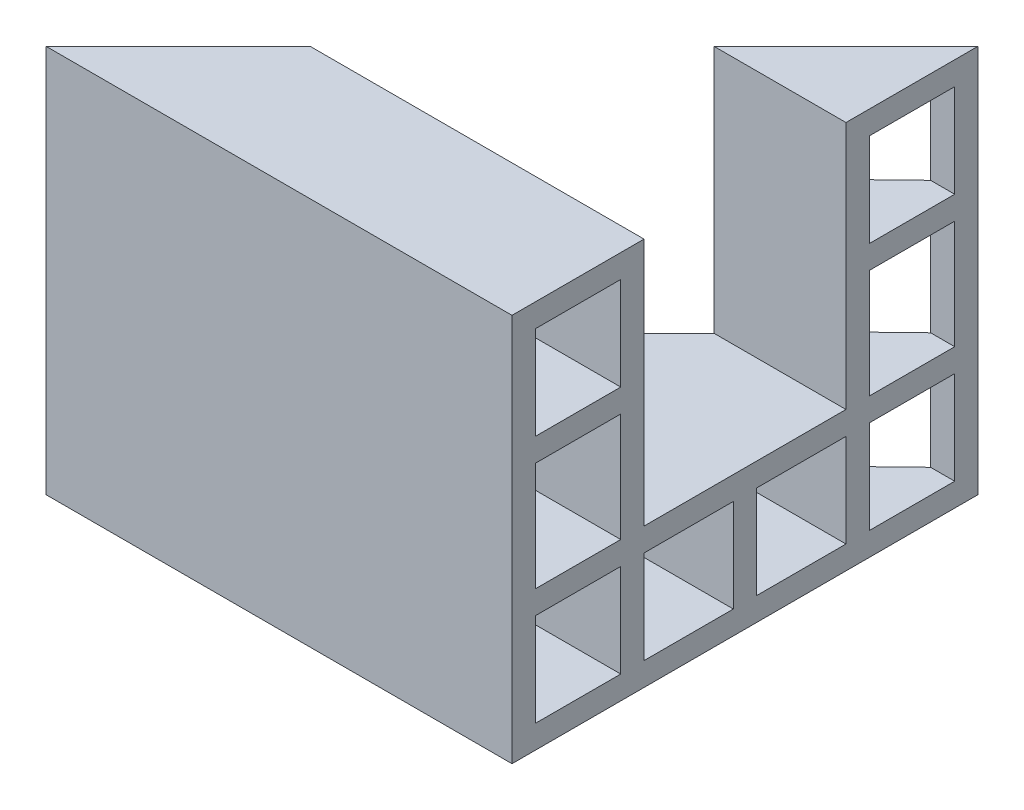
ISO-10303-21;
HEADER;
FILE_DESCRIPTION(('STEP AP214'),'2;1');
FILE_NAME('part.step','',(''),(''),'','','');
FILE_SCHEMA(('AUTOMOTIVE_DESIGN { 1 0 10303 214 1 1 1 1 }'));
ENDSEC;
DATA;
#1=APPLICATION_CONTEXT('core data for automotive mechanical design processes');
#2=APPLICATION_PROTOCOL_DEFINITION('international standard','automotive_design',2000,#1);
#3=PRODUCT_CONTEXT('',#1,'mechanical');
#4=PRODUCT('Part','Part','',(#3));
#5=PRODUCT_RELATED_PRODUCT_CATEGORY('part','',(#4));
#6=PRODUCT_DEFINITION_FORMATION('','',#4);
#7=PRODUCT_DEFINITION_CONTEXT('part definition',#1,'design');
#8=PRODUCT_DEFINITION('design','',#6,#7);
#9=PRODUCT_DEFINITION_SHAPE('','',#8);
#10=(LENGTH_UNIT() NAMED_UNIT(*) SI_UNIT(.MILLI.,.METRE.));
#11=(NAMED_UNIT(*) PLANE_ANGLE_UNIT() SI_UNIT($,.RADIAN.));
#12=(NAMED_UNIT(*) SI_UNIT($,.STERADIAN.) SOLID_ANGLE_UNIT());
#13=UNCERTAINTY_MEASURE_WITH_UNIT(LENGTH_MEASURE(1.E-05),#10,'distance_accuracy_value','');
#14=(GEOMETRIC_REPRESENTATION_CONTEXT(3) GLOBAL_UNCERTAINTY_ASSIGNED_CONTEXT((#13)) GLOBAL_UNIT_ASSIGNED_CONTEXT((#10,
#11,#12)) REPRESENTATION_CONTEXT('',''));
#15=CARTESIAN_POINT('',(0.,0.,0.));
#16=DIRECTION('',(0.,0.,1.));
#17=DIRECTION('',(1.,0.,0.));
#18=AXIS2_PLACEMENT_3D('',#15,#16,#17);
#19=CARTESIAN_POINT('',(30.,9.,-21.5));
#20=DIRECTION('',(-1.,0.,0.));
#21=DIRECTION('',(0.,0.,1.));
#22=AXIS2_PLACEMENT_3D('',#19,#20,#21);
#23=PLANE('',#22);
#24=DIRECTION('',(0.,0.,1.));
#25=VECTOR('',#24,1.);
#26=CARTESIAN_POINT('',(30.,16.,-28.5));
#27=LINE('',#26,#25);
#28=CARTESIAN_POINT('',(30.,16.,-28.5));
#29=VERTEX_POINT('',#28);
#30=CARTESIAN_POINT('',(30.,16.,-23.));
#31=VERTEX_POINT('',#30);
#32=EDGE_CURVE('E403',#29,#31,#27,.T.);
#33=ORIENTED_EDGE('',*,*,#32,.F.);
#34=DIRECTION('',(0.,1.,0.));
#35=VECTOR('',#34,1.);
#36=CARTESIAN_POINT('',(30.,16.,-28.5));
#37=LINE('',#36,#35);
#38=CARTESIAN_POINT('',(30.,9.,-28.5));
#39=VERTEX_POINT('',#38);
#40=EDGE_CURVE('E413',#39,#29,#37,.T.);
#41=ORIENTED_EDGE('',*,*,#40,.F.);
#42=DIRECTION('',(0.,0.,-1.));
#43=VECTOR('',#42,1.);
#44=CARTESIAN_POINT('',(30.,9.,-28.5));
#45=LINE('',#44,#43);
#46=CARTESIAN_POINT('',(30.,9.,-23.));
#47=VERTEX_POINT('',#46);
#48=EDGE_CURVE('E428',#47,#39,#45,.T.);
#49=ORIENTED_EDGE('',*,*,#48,.F.);
#50=DIRECTION('',(0.,-1.,0.));
#51=VECTOR('',#50,1.);
#52=CARTESIAN_POINT('',(30.,16.,-23.));
#53=LINE('',#52,#51);
#54=EDGE_CURVE('E510',#31,#47,#53,.T.);
#55=ORIENTED_EDGE('',*,*,#54,.F.);
#56=EDGE_LOOP('',(#33,#41,#49,#55));
#57=FACE_BOUND('',#56,.T.);
#58=DIRECTION('',(0.,0.,1.));
#59=VECTOR('',#58,1.);
#60=CARTESIAN_POINT('',(30.,7.5,-21.5));
#61=LINE('',#60,#59);
#62=CARTESIAN_POINT('',(30.,7.5,-21.5));
#63=VERTEX_POINT('',#62);
#64=CARTESIAN_POINT('',(30.,7.5,-15.75));
#65=VERTEX_POINT('',#64);
#66=EDGE_CURVE('E316',#63,#65,#61,.T.);
#67=ORIENTED_EDGE('',*,*,#66,.F.);
#68=DIRECTION('',(0.,1.,0.));
#69=VECTOR('',#68,1.);
#70=CARTESIAN_POINT('',(30.,7.5,-21.5));
#71=LINE('',#70,#69);
#72=CARTESIAN_POINT('',(30.,1.5,-21.5));
#73=VERTEX_POINT('',#72);
#74=EDGE_CURVE('E385',#73,#63,#71,.T.);
#75=ORIENTED_EDGE('',*,*,#74,.F.);
#76=DIRECTION('',(0.,0.,-1.));
#77=VECTOR('',#76,1.);
#78=CARTESIAN_POINT('',(30.,1.5,-21.5));
#79=LINE('',#78,#77);
#80=CARTESIAN_POINT('',(30.,1.5,-15.75));
#81=VERTEX_POINT('',#80);
#82=EDGE_CURVE('E524',#81,#73,#79,.T.);
#83=ORIENTED_EDGE('',*,*,#82,.F.);
#84=DIRECTION('',(0.,-1.,0.));
#85=VECTOR('',#84,1.);
#86=CARTESIAN_POINT('',(30.,7.5,-15.75));
#87=LINE('',#86,#85);
#88=EDGE_CURVE('E522',#65,#81,#87,.T.);
#89=ORIENTED_EDGE('',*,*,#88,.F.);
#90=EDGE_LOOP('',(#67,#75,#83,#89));
#91=FACE_BOUND('',#90,.T.);
#92=DIRECTION('',(0.,0.,-1.));
#93=VECTOR('',#92,1.);
#94=CARTESIAN_POINT('',(30.,17.5,-1.5));
#95=LINE('',#94,#93);
#96=CARTESIAN_POINT('',(30.,17.5,-1.5));
#97=VERTEX_POINT('',#96);
#98=CARTESIAN_POINT('',(30.,17.5,-7.));
#99=VERTEX_POINT('',#98);
#100=EDGE_CURVE('E344',#97,#99,#95,.T.);
#101=ORIENTED_EDGE('',*,*,#100,.F.);
#102=DIRECTION('',(0.,-1.,0.));
#103=VECTOR('',#102,1.);
#104=CARTESIAN_POINT('',(30.,17.5,-1.5));
#105=LINE('',#104,#103);
#106=CARTESIAN_POINT('',(30.,23.5,-1.5));
#107=VERTEX_POINT('',#106);
#108=EDGE_CURVE('E365',#107,#97,#105,.T.);
#109=ORIENTED_EDGE('',*,*,#108,.F.);
#110=DIRECTION('',(0.,0.,1.));
#111=VECTOR('',#110,1.);
#112=CARTESIAN_POINT('',(30.,23.5,-1.5));
#113=LINE('',#112,#111);
#114=CARTESIAN_POINT('',(30.,23.5,-7.));
#115=VERTEX_POINT('',#114);
#116=EDGE_CURVE('E538',#115,#107,#113,.T.);
#117=ORIENTED_EDGE('',*,*,#116,.F.);
#118=DIRECTION('',(0.,1.,0.));
#119=VECTOR('',#118,1.);
#120=CARTESIAN_POINT('',(30.,17.5,-7.));
#121=LINE('',#120,#119);
#122=EDGE_CURVE('E536',#99,#115,#121,.T.);
#123=ORIENTED_EDGE('',*,*,#122,.F.);
#124=EDGE_LOOP('',(#101,#109,#117,#123));
#125=FACE_BOUND('',#124,.T.);
#126=DIRECTION('',(0.,-1.,0.));
#127=VECTOR('',#126,1.);
#128=CARTESIAN_POINT('',(30.,7.5,-8.5));
#129=LINE('',#128,#127);
#130=CARTESIAN_POINT('',(30.,7.5,-8.5));
#131=VERTEX_POINT('',#130);
#132=CARTESIAN_POINT('',(30.,1.5,-8.5));
#133=VERTEX_POINT('',#132);
#134=EDGE_CURVE('E338',#131,#133,#129,.T.);
#135=ORIENTED_EDGE('',*,*,#134,.F.);
#136=DIRECTION('',(0.,0.,1.));
#137=VECTOR('',#136,1.);
#138=CARTESIAN_POINT('',(30.,7.5,-8.5));
#139=LINE('',#138,#137);
#140=CARTESIAN_POINT('',(30.,7.5,-14.25));
#141=VERTEX_POINT('',#140);
#142=EDGE_CURVE('E376',#141,#131,#139,.T.);
#143=ORIENTED_EDGE('',*,*,#142,.F.);
#144=DIRECTION('',(0.,1.,0.));
#145=VECTOR('',#144,1.);
#146=CARTESIAN_POINT('',(30.,7.5,-14.25));
#147=LINE('',#146,#145);
#148=CARTESIAN_POINT('',(30.,1.5,-14.25));
#149=VERTEX_POINT('',#148);
#150=EDGE_CURVE('E552',#149,#141,#147,.T.);
#151=ORIENTED_EDGE('',*,*,#150,.F.);
#152=DIRECTION('',(0.,0.,-1.));
#153=VECTOR('',#152,1.);
#154=CARTESIAN_POINT('',(30.,1.5,-8.5));
#155=LINE('',#154,#153);
#156=EDGE_CURVE('E550',#133,#149,#155,.T.);
#157=ORIENTED_EDGE('',*,*,#156,.F.);
#158=EDGE_LOOP('',(#135,#143,#151,#157));
#159=FACE_BOUND('',#158,.T.);
#160=DIRECTION('',(0.,-1.,0.));
#161=VECTOR('',#160,1.);
#162=CARTESIAN_POINT('',(30.,9.,-21.5));
#163=LINE('',#162,#161);
#164=CARTESIAN_POINT('',(30.,25.,-21.5));
#165=VERTEX_POINT('',#164);
#166=CARTESIAN_POINT('',(30.,9.,-21.5));
#167=VERTEX_POINT('',#166);
#168=EDGE_CURVE('E285',#165,#167,#163,.T.);
#169=ORIENTED_EDGE('',*,*,#168,.T.);
#170=DIRECTION('',(0.,0.,1.));
#171=VECTOR('',#170,1.);
#172=CARTESIAN_POINT('',(30.,9.,-8.5));
#173=LINE('',#172,#171);
#174=CARTESIAN_POINT('',(30.,9.,-8.5));
#175=VERTEX_POINT('',#174);
#176=EDGE_CURVE('E558',#167,#175,#173,.T.);
#177=ORIENTED_EDGE('',*,*,#176,.T.);
#178=DIRECTION('',(0.,1.,0.));
#179=VECTOR('',#178,1.);
#180=CARTESIAN_POINT('',(30.,9.,-8.5));
#181=LINE('',#180,#179);
#182=CARTESIAN_POINT('',(30.,25.,-8.5));
#183=VERTEX_POINT('',#182);
#184=EDGE_CURVE('E560',#175,#183,#181,.T.);
#185=ORIENTED_EDGE('',*,*,#184,.T.);
#186=DIRECTION('',(0.,0.,1.));
#187=VECTOR('',#186,1.);
#188=CARTESIAN_POINT('',(30.,25.,-8.5));
#189=LINE('',#188,#187);
#190=CARTESIAN_POINT('',(30.,25.,0.));
#191=VERTEX_POINT('',#190);
#192=EDGE_CURVE('E562',#183,#191,#189,.T.);
#193=ORIENTED_EDGE('',*,*,#192,.T.);
#194=DIRECTION('',(0.,-1.,0.));
#195=VECTOR('',#194,1.);
#196=CARTESIAN_POINT('',(30.,25.,0.));
#197=LINE('',#196,#195);
#198=CARTESIAN_POINT('',(30.,0.,0.));
#199=VERTEX_POINT('',#198);
#200=EDGE_CURVE('E300',#191,#199,#197,.T.);
#201=ORIENTED_EDGE('',*,*,#200,.T.);
#202=DIRECTION('',(0.,0.,-1.));
#203=VECTOR('',#202,1.);
#204=CARTESIAN_POINT('',(30.,0.,0.));
#205=LINE('',#204,#203);
#206=CARTESIAN_POINT('',(30.,0.,-30.));
#207=VERTEX_POINT('',#206);
#208=EDGE_CURVE('E565',#199,#207,#205,.T.);
#209=ORIENTED_EDGE('',*,*,#208,.T.);
#210=DIRECTION('',(0.,1.,0.));
#211=VECTOR('',#210,1.);
#212=CARTESIAN_POINT('',(30.,25.,-30.));
#213=LINE('',#212,#211);
#214=CARTESIAN_POINT('',(30.,25.,-30.));
#215=VERTEX_POINT('',#214);
#216=EDGE_CURVE('E568',#207,#215,#213,.T.);
#217=ORIENTED_EDGE('',*,*,#216,.T.);
#218=DIRECTION('',(0.,0.,1.));
#219=VECTOR('',#218,1.);
#220=CARTESIAN_POINT('',(30.,25.,-21.5));
#221=LINE('',#220,#219);
#222=EDGE_CURVE('E571',#215,#165,#221,.T.);
#223=ORIENTED_EDGE('',*,*,#222,.T.);
#224=EDGE_LOOP('',(#169,#177,#185,#193,#201,#209,#217,#223));
#225=FACE_BOUND('',#224,.T.);
#226=DIRECTION('',(0.,-1.,0.));
#227=VECTOR('',#226,1.);
#228=CARTESIAN_POINT('',(30.,7.5,-1.5));
#229=LINE('',#228,#227);
#230=CARTESIAN_POINT('',(30.,7.5,-1.5));
#231=VERTEX_POINT('',#230);
#232=CARTESIAN_POINT('',(30.,1.5,-1.5));
#233=VERTEX_POINT('',#232);
#234=EDGE_CURVE('E368',#231,#233,#229,.T.);
#235=ORIENTED_EDGE('',*,*,#234,.F.);
#236=DIRECTION('',(0.,0.,1.));
#237=VECTOR('',#236,1.);
#238=CARTESIAN_POINT('',(30.,7.5,-1.5));
#239=LINE('',#238,#237);
#240=CARTESIAN_POINT('',(30.,7.5,-7.));
#241=VERTEX_POINT('',#240);
#242=EDGE_CURVE('E334',#241,#231,#239,.T.);
#243=ORIENTED_EDGE('',*,*,#242,.F.);
#244=DIRECTION('',(0.,1.,0.));
#245=VECTOR('',#244,1.);
#246=CARTESIAN_POINT('',(30.,7.5,-7.));
#247=LINE('',#246,#245);
#248=CARTESIAN_POINT('',(30.,1.5,-7.));
#249=VERTEX_POINT('',#248);
#250=EDGE_CURVE('E545',#249,#241,#247,.T.);
#251=ORIENTED_EDGE('',*,*,#250,.F.);
#252=DIRECTION('',(0.,0.,-1.));
#253=VECTOR('',#252,1.);
#254=CARTESIAN_POINT('',(30.,1.5,-1.5));
#255=LINE('',#254,#253);
#256=EDGE_CURVE('E543',#233,#249,#255,.T.);
#257=ORIENTED_EDGE('',*,*,#256,.F.);
#258=EDGE_LOOP('',(#235,#243,#251,#257));
#259=FACE_BOUND('',#258,.T.);
#260=DIRECTION('',(0.,1.,0.));
#261=VECTOR('',#260,1.);
#262=CARTESIAN_POINT('',(30.,16.,-7.));
#263=LINE('',#262,#261);
#264=CARTESIAN_POINT('',(30.,9.,-7.));
#265=VERTEX_POINT('',#264);
#266=CARTESIAN_POINT('',(30.,16.,-7.));
#267=VERTEX_POINT('',#266);
#268=EDGE_CURVE('E389',#265,#267,#263,.T.);
#269=ORIENTED_EDGE('',*,*,#268,.F.);
#270=DIRECTION('',(0.,0.,-1.));
#271=VECTOR('',#270,1.);
#272=CARTESIAN_POINT('',(30.,9.,-1.5));
#273=LINE('',#272,#271);
#274=CARTESIAN_POINT('',(30.,9.,-1.5));
#275=VERTEX_POINT('',#274);
#276=EDGE_CURVE('E354',#275,#265,#273,.T.);
#277=ORIENTED_EDGE('',*,*,#276,.F.);
#278=DIRECTION('',(0.,-1.,0.));
#279=VECTOR('',#278,1.);
#280=CARTESIAN_POINT('',(30.,16.,-1.5));
#281=LINE('',#280,#279);
#282=CARTESIAN_POINT('',(30.,16.,-1.5));
#283=VERTEX_POINT('',#282);
#284=EDGE_CURVE('E531',#283,#275,#281,.T.);
#285=ORIENTED_EDGE('',*,*,#284,.F.);
#286=DIRECTION('',(0.,0.,1.));
#287=VECTOR('',#286,1.);
#288=CARTESIAN_POINT('',(30.,16.,-1.5));
#289=LINE('',#288,#287);
#290=EDGE_CURVE('E529',#267,#283,#289,.T.);
#291=ORIENTED_EDGE('',*,*,#290,.F.);
#292=EDGE_LOOP('',(#269,#277,#285,#291));
#293=FACE_BOUND('',#292,.T.);
#294=DIRECTION('',(0.,1.,0.));
#295=VECTOR('',#294,1.);
#296=CARTESIAN_POINT('',(30.,17.5,-28.5));
#297=LINE('',#296,#295);
#298=CARTESIAN_POINT('',(30.,17.5,-28.5));
#299=VERTEX_POINT('',#298);
#300=CARTESIAN_POINT('',(30.,23.5,-28.5));
#301=VERTEX_POINT('',#300);
#302=EDGE_CURVE('E417',#299,#301,#297,.T.);
#303=ORIENTED_EDGE('',*,*,#302,.F.);
#304=DIRECTION('',(0.,0.,-1.));
#305=VECTOR('',#304,1.);
#306=CARTESIAN_POINT('',(30.,17.5,-28.5));
#307=LINE('',#306,#305);
#308=CARTESIAN_POINT('',(30.,17.5,-23.));
#309=VERTEX_POINT('',#308);
#310=EDGE_CURVE('E326',#309,#299,#307,.T.);
#311=ORIENTED_EDGE('',*,*,#310,.F.);
#312=DIRECTION('',(0.,-1.,0.));
#313=VECTOR('',#312,1.);
#314=CARTESIAN_POINT('',(30.,17.5,-23.));
#315=LINE('',#314,#313);
#316=CARTESIAN_POINT('',(30.,23.5,-23.));
#317=VERTEX_POINT('',#316);
#318=EDGE_CURVE('E517',#317,#309,#315,.T.);
#319=ORIENTED_EDGE('',*,*,#318,.F.);
#320=DIRECTION('',(0.,0.,1.));
#321=VECTOR('',#320,1.);
#322=CARTESIAN_POINT('',(30.,23.5,-28.5));
#323=LINE('',#322,#321);
#324=EDGE_CURVE('E515',#301,#317,#323,.T.);
#325=ORIENTED_EDGE('',*,*,#324,.F.);
#326=EDGE_LOOP('',(#303,#311,#319,#325));
#327=FACE_BOUND('',#326,.T.);
#328=DIRECTION('',(0.,0.,1.));
#329=VECTOR('',#328,1.);
#330=CARTESIAN_POINT('',(30.,7.5,-28.5));
#331=LINE('',#330,#329);
#332=CARTESIAN_POINT('',(30.,7.5,-28.5));
#333=VERTEX_POINT('',#332);
#334=CARTESIAN_POINT('',(30.,7.5,-23.));
#335=VERTEX_POINT('',#334);
#336=EDGE_CURVE('E501',#333,#335,#331,.T.);
#337=ORIENTED_EDGE('',*,*,#336,.F.);
#338=DIRECTION('',(0.,1.,0.));
#339=VECTOR('',#338,1.);
#340=CARTESIAN_POINT('',(30.,7.5,-28.5));
#341=LINE('',#340,#339);
#342=CARTESIAN_POINT('',(30.,1.49999999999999,-28.5));
#343=VERTEX_POINT('',#342);
#344=EDGE_CURVE('E399',#343,#333,#341,.T.);
#345=ORIENTED_EDGE('',*,*,#344,.F.);
#346=DIRECTION('',(0.,0.,-1.));
#347=VECTOR('',#346,1.);
#348=CARTESIAN_POINT('',(30.,1.49999999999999,-28.5));
#349=LINE('',#348,#347);
#350=CARTESIAN_POINT('',(30.,1.49999999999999,-23.));
#351=VERTEX_POINT('',#350);
#352=EDGE_CURVE('E505',#351,#343,#349,.T.);
#353=ORIENTED_EDGE('',*,*,#352,.F.);
#354=DIRECTION('',(0.,-1.,0.));
#355=VECTOR('',#354,1.);
#356=CARTESIAN_POINT('',(30.,7.5,-23.));
#357=LINE('',#356,#355);
#358=EDGE_CURVE('E503',#335,#351,#357,.T.);
#359=ORIENTED_EDGE('',*,*,#358,.F.);
#360=EDGE_LOOP('',(#337,#345,#353,#359));
#361=FACE_BOUND('',#360,.T.);
#362=ADVANCED_FACE('F26',(#57,#91,#125,#159,#225,#259,#293,#327,#361),#23,.F.);
#363=CARTESIAN_POINT('',(30.,9.,-21.5));
#364=DIRECTION('',(0.,0.,-1.));
#365=DIRECTION('',(0.,1.,0.));
#366=AXIS2_PLACEMENT_3D('',#363,#364,#365);
#367=PLANE('',#366);
#368=DIRECTION('',(-1.,0.,0.));
#369=VECTOR('',#368,1.);
#370=CARTESIAN_POINT('',(30.,25.,-21.5));
#371=LINE('',#370,#369);
#372=CARTESIAN_POINT('',(21.5,25.,-21.5));
#373=VERTEX_POINT('',#372);
#374=EDGE_CURVE('E305',#165,#373,#371,.T.);
#375=ORIENTED_EDGE('',*,*,#374,.T.);
#376=DIRECTION('',(0.,-1.,0.));
#377=VECTOR('',#376,1.);
#378=CARTESIAN_POINT('',(21.5,9.,-21.5));
#379=LINE('',#378,#377);
#380=CARTESIAN_POINT('',(21.5,9.,-21.5));
#381=VERTEX_POINT('',#380);
#382=EDGE_CURVE('E41',#373,#381,#379,.T.);
#383=ORIENTED_EDGE('',*,*,#382,.T.);
#384=DIRECTION('',(-1.,0.,0.));
#385=VECTOR('',#384,1.);
#386=CARTESIAN_POINT('',(30.,9.,-21.5));
#387=LINE('',#386,#385);
#388=EDGE_CURVE('E34',#167,#381,#387,.T.);
#389=ORIENTED_EDGE('',*,*,#388,.F.);
#390=ORIENTED_EDGE('',*,*,#168,.F.);
#391=EDGE_LOOP('',(#375,#383,#389,#390));
#392=FACE_BOUND('',#391,.T.);
#393=ADVANCED_FACE('F576',(#392),#367,.F.);
#394=CARTESIAN_POINT('',(30.,9.,-8.5));
#395=DIRECTION('',(0.,-1.,0.));
#396=DIRECTION('',(0.,0.,-1.));
#397=AXIS2_PLACEMENT_3D('',#394,#395,#396);
#398=PLANE('',#397);
#399=ORIENTED_EDGE('',*,*,#388,.T.);
#400=DIRECTION('',(-0.707106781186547,0.,0.707106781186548));
#401=VECTOR('',#400,1.);
#402=CARTESIAN_POINT('',(19.25,9.,-19.25));
#403=LINE('',#402,#401);
#404=CARTESIAN_POINT('',(8.49999999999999,9.,-8.5));
#405=VERTEX_POINT('',#404);
#406=EDGE_CURVE('E497',#381,#405,#403,.T.);
#407=ORIENTED_EDGE('',*,*,#406,.T.);
#408=DIRECTION('',(-1.,0.,0.));
#409=VECTOR('',#408,1.);
#410=CARTESIAN_POINT('',(30.,9.,-8.5));
#411=LINE('',#410,#409);
#412=EDGE_CURVE('E303',#175,#405,#411,.T.);
#413=ORIENTED_EDGE('',*,*,#412,.F.);
#414=ORIENTED_EDGE('',*,*,#176,.F.);
#415=EDGE_LOOP('',(#399,#407,#413,#414));
#416=FACE_BOUND('',#415,.T.);
#417=ADVANCED_FACE('F620',(#416),#398,.F.);
#418=CARTESIAN_POINT('',(30.,9.,-8.5));
#419=DIRECTION('',(0.,0.,1.));
#420=DIRECTION('',(1.,0.,0.));
#421=AXIS2_PLACEMENT_3D('',#418,#419,#420);
#422=PLANE('',#421);
#423=ORIENTED_EDGE('',*,*,#412,.T.);
#424=DIRECTION('',(0.,1.,0.));
#425=VECTOR('',#424,1.);
#426=CARTESIAN_POINT('',(8.49999999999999,9.00000000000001,-8.5));
#427=LINE('',#426,#425);
#428=CARTESIAN_POINT('',(8.49999999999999,25.,-8.5));
#429=VERTEX_POINT('',#428);
#430=EDGE_CURVE('E495',#405,#429,#427,.T.);
#431=ORIENTED_EDGE('',*,*,#430,.T.);
#432=DIRECTION('',(-1.,0.,0.));
#433=VECTOR('',#432,1.);
#434=CARTESIAN_POINT('',(30.,25.,-8.5));
#435=LINE('',#434,#433);
#436=EDGE_CURVE('E296',#183,#429,#435,.T.);
#437=ORIENTED_EDGE('',*,*,#436,.F.);
#438=ORIENTED_EDGE('',*,*,#184,.F.);
#439=EDGE_LOOP('',(#423,#431,#437,#438));
#440=FACE_BOUND('',#439,.T.);
#441=ADVANCED_FACE('F637',(#440),#422,.F.);
#442=CARTESIAN_POINT('',(30.,25.,-8.5));
#443=DIRECTION('',(0.,-1.,0.));
#444=DIRECTION('',(0.,0.,-1.));
#445=AXIS2_PLACEMENT_3D('',#442,#443,#444);
#446=PLANE('',#445);
#447=ORIENTED_EDGE('',*,*,#436,.T.);
#448=DIRECTION('',(0.707106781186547,0.,-0.707106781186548));
#449=VECTOR('',#448,1.);
#450=CARTESIAN_POINT('',(-1.26891110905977,25.,1.26891110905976));
#451=LINE('',#450,#449);
#452=CARTESIAN_POINT('',(0.,25.,0.));
#453=VERTEX_POINT('',#452);
#454=EDGE_CURVE('E277',#453,#429,#451,.T.);
#455=ORIENTED_EDGE('',*,*,#454,.F.);
#456=DIRECTION('',(-1.,0.,0.));
#457=VECTOR('',#456,1.);
#458=CARTESIAN_POINT('',(30.,25.,0.));
#459=LINE('',#458,#457);
#460=EDGE_CURVE('E293',#191,#453,#459,.T.);
#461=ORIENTED_EDGE('',*,*,#460,.F.);
#462=ORIENTED_EDGE('',*,*,#192,.F.);
#463=EDGE_LOOP('',(#447,#455,#461,#462));
#464=FACE_BOUND('',#463,.T.);
#465=ADVANCED_FACE('F291',(#464),#446,.F.);
#466=CARTESIAN_POINT('',(30.,25.,0.));
#467=DIRECTION('',(0.,0.,-1.));
#468=DIRECTION('',(-1.,0.,0.));
#469=AXIS2_PLACEMENT_3D('',#466,#467,#468);
#470=PLANE('',#469);
#471=DIRECTION('',(0.,-1.,0.));
#472=VECTOR('',#471,1.);
#473=CARTESIAN_POINT('',(0.,25.,0.));
#474=LINE('',#473,#472);
#475=CARTESIAN_POINT('',(0.,0.,0.));
#476=VERTEX_POINT('',#475);
#477=EDGE_CURVE('E274',#453,#476,#474,.T.);
#478=ORIENTED_EDGE('',*,*,#477,.T.);
#479=DIRECTION('',(-1.,0.,0.));
#480=VECTOR('',#479,1.);
#481=CARTESIAN_POINT('',(30.,0.,0.));
#482=LINE('',#481,#480);
#483=EDGE_CURVE('E301',#199,#476,#482,.T.);
#484=ORIENTED_EDGE('',*,*,#483,.F.);
#485=ORIENTED_EDGE('',*,*,#200,.F.);
#486=ORIENTED_EDGE('',*,*,#460,.T.);
#487=EDGE_LOOP('',(#478,#484,#485,#486));
#488=FACE_BOUND('',#487,.T.);
#489=ADVANCED_FACE('F299',(#488),#470,.F.);
#490=CARTESIAN_POINT('',(30.,0.,0.));
#491=DIRECTION('',(0.,1.,0.));
#492=DIRECTION('',(0.,0.,1.));
#493=AXIS2_PLACEMENT_3D('',#490,#491,#492);
#494=PLANE('',#493);
#495=ORIENTED_EDGE('',*,*,#483,.T.);
#496=DIRECTION('',(0.707106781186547,0.,-0.707106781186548));
#497=VECTOR('',#496,1.);
#498=CARTESIAN_POINT('',(-1.26891110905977,0.,1.26891110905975));
#499=LINE('',#498,#497);
#500=EDGE_CURVE('E280',#476,#207,#499,.T.);
#501=ORIENTED_EDGE('',*,*,#500,.T.);
#502=ORIENTED_EDGE('',*,*,#208,.F.);
#503=EDGE_LOOP('',(#495,#501,#502));
#504=FACE_BOUND('',#503,.T.);
#505=ADVANCED_FACE('F629',(#504),#494,.F.);
#506=CARTESIAN_POINT('',(30.,25.,-21.5));
#507=DIRECTION('',(0.,-1.,0.));
#508=DIRECTION('',(0.,0.,-1.));
#509=AXIS2_PLACEMENT_3D('',#506,#507,#508);
#510=PLANE('',#509);
#511=ORIENTED_EDGE('',*,*,#222,.F.);
#512=EDGE_CURVE('E297',#373,#215,#451,.T.);
#513=ORIENTED_EDGE('',*,*,#512,.F.);
#514=ORIENTED_EDGE('',*,*,#374,.F.);
#515=EDGE_LOOP('',(#511,#513,#514));
#516=FACE_BOUND('',#515,.T.);
#517=ADVANCED_FACE('F580',(#516),#510,.F.);
#518=CARTESIAN_POINT('',(30.,7.5,-8.5));
#519=DIRECTION('',(0.0174524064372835,0.,-0.999847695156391));
#520=DIRECTION('',(-0.999847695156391,0.,-0.0174524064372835));
#521=AXIS2_PLACEMENT_3D('',#518,#519,#520);
#522=PLANE('',#521);
#523=DIRECTION('',(0.,-1.,0.));
#524=VECTOR('',#523,1.);
#525=CARTESIAN_POINT('',(8.86884567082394,7.50000000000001,-8.86884567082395));
#526=LINE('',#525,#524);
#527=CARTESIAN_POINT('',(8.86884567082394,7.13115432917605,-8.86884567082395));
#528=VERTEX_POINT('',#527);
#529=CARTESIAN_POINT('',(8.86884567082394,1.86884567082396,-8.86884567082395));
#530=VERTEX_POINT('',#529);
#531=EDGE_CURVE('E493',#528,#530,#526,.T.);
#532=ORIENTED_EDGE('',*,*,#531,.F.);
#533=DIRECTION('',(-0.999695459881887,-0.0174497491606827,-0.0174497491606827));
#534=VECTOR('',#533,1.);
#535=CARTESIAN_POINT('',(30.,7.5,-8.5));
#536=LINE('',#535,#534);
#537=EDGE_CURVE('E373',#131,#528,#536,.T.);
#538=ORIENTED_EDGE('',*,*,#537,.F.);
#539=ORIENTED_EDGE('',*,*,#134,.T.);
#540=DIRECTION('',(-0.999695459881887,0.0174497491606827,-0.0174497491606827));
#541=VECTOR('',#540,1.);
#542=CARTESIAN_POINT('',(30.,1.5,-8.5));
#543=LINE('',#542,#541);
#544=EDGE_CURVE('E286',#133,#530,#543,.T.);
#545=ORIENTED_EDGE('',*,*,#544,.T.);
#546=EDGE_LOOP('',(#532,#538,#539,#545));
#547=FACE_BOUND('',#546,.T.);
#548=ADVANCED_FACE('F628',(#547),#522,.T.);
#549=CARTESIAN_POINT('',(30.,1.5,-8.5));
#550=DIRECTION('',(0.0174524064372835,0.999847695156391,0.));
#551=DIRECTION('',(-0.999847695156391,0.0174524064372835,0.));
#552=AXIS2_PLACEMENT_3D('',#549,#550,#551);
#553=PLANE('',#552);
#554=DIRECTION('',(0.707052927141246,-0.0123416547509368,-0.707052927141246));
#555=VECTOR('',#554,1.);
#556=CARTESIAN_POINT('',(19.2516374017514,1.68761336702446,-19.2516374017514));
#557=LINE('',#556,#555);
#558=CARTESIAN_POINT('',(13.9701987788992,1.77980122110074,-13.9701987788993));
#559=VERTEX_POINT('',#558);
#560=EDGE_CURVE('E491',#530,#559,#557,.T.);
#561=ORIENTED_EDGE('',*,*,#560,.F.);
#562=ORIENTED_EDGE('',*,*,#544,.F.);
#563=ORIENTED_EDGE('',*,*,#156,.T.);
#564=DIRECTION('',(-0.999695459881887,0.0174497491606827,0.0174497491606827));
#565=VECTOR('',#564,1.);
#566=CARTESIAN_POINT('',(29.8953333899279,1.50182696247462,-14.2481730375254));
#567=LINE('',#566,#565);
#568=EDGE_CURVE('E372',#149,#559,#567,.T.);
#569=ORIENTED_EDGE('',*,*,#568,.T.);
#570=EDGE_LOOP('',(#561,#562,#563,#569));
#571=FACE_BOUND('',#570,.T.);
#572=ADVANCED_FACE('F689',(#571),#553,.T.);
#573=CARTESIAN_POINT('',(30.,7.5,-14.25));
#574=DIRECTION('',(0.0174524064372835,0.,0.999847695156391));
#575=DIRECTION('',(0.999847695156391,0.,-0.0174524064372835));
#576=AXIS2_PLACEMENT_3D('',#573,#574,#575);
#577=PLANE('',#576);
#578=DIRECTION('',(0.,1.,0.));
#579=VECTOR('',#578,1.);
#580=CARTESIAN_POINT('',(13.9701987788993,7.50000000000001,-13.9701987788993));
#581=LINE('',#580,#579);
#582=CARTESIAN_POINT('',(13.9701987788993,7.22019877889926,-13.9701987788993));
#583=VERTEX_POINT('',#582);
#584=EDGE_CURVE('E49',#559,#583,#581,.T.);
#585=ORIENTED_EDGE('',*,*,#584,.F.);
#586=ORIENTED_EDGE('',*,*,#568,.F.);
#587=ORIENTED_EDGE('',*,*,#150,.T.);
#588=DIRECTION('',(-0.999695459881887,-0.0174497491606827,0.0174497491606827));
#589=VECTOR('',#588,1.);
#590=CARTESIAN_POINT('',(29.8996944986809,7.49824916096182,-14.2482491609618));
#591=LINE('',#590,#589);
#592=EDGE_CURVE('E369',#141,#583,#591,.T.);
#593=ORIENTED_EDGE('',*,*,#592,.T.);
#594=EDGE_LOOP('',(#585,#586,#587,#593));
#595=FACE_BOUND('',#594,.T.);
#596=ADVANCED_FACE('F698',(#595),#577,.T.);
#597=CARTESIAN_POINT('',(30.,7.5,-8.5));
#598=DIRECTION('',(0.0174524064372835,-0.999847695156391,0.));
#599=DIRECTION('',(0.999847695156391,0.0174524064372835,0.));
#600=AXIS2_PLACEMENT_3D('',#597,#598,#599);
#601=PLANE('',#600);
#602=DIRECTION('',(-0.707052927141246,-0.0123416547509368,0.707052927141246));
#603=VECTOR('',#602,1.);
#604=CARTESIAN_POINT('',(19.2516374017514,7.31238663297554,-19.2516374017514));
#605=LINE('',#604,#603);
#606=EDGE_CURVE('E488',#583,#528,#605,.T.);
#607=ORIENTED_EDGE('',*,*,#606,.F.);
#608=ORIENTED_EDGE('',*,*,#592,.F.);
#609=ORIENTED_EDGE('',*,*,#142,.T.);
#610=ORIENTED_EDGE('',*,*,#537,.T.);
#611=EDGE_LOOP('',(#607,#608,#609,#610));
#612=FACE_BOUND('',#611,.T.);
#613=ADVANCED_FACE('F700',(#612),#601,.T.);
#614=CARTESIAN_POINT('',(30.,7.5,-1.5));
#615=DIRECTION('',(0.0174524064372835,0.,-0.999847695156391));
#616=DIRECTION('',(-0.999847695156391,0.,-0.0174524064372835));
#617=AXIS2_PLACEMENT_3D('',#614,#615,#616);
#618=PLANE('',#617);
#619=DIRECTION('',(0.,-1.,0.));
#620=VECTOR('',#619,1.);
#621=CARTESIAN_POINT('',(1.98893495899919,7.50000000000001,-1.9889349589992));
#622=LINE('',#621,#620);
#623=CARTESIAN_POINT('',(1.9889349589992,7.0110650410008,-1.9889349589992));
#624=VERTEX_POINT('',#623);
#625=CARTESIAN_POINT('',(1.98893495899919,1.9889349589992,-1.9889349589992));
#626=VERTEX_POINT('',#625);
#627=EDGE_CURVE('E486',#624,#626,#622,.T.);
#628=ORIENTED_EDGE('',*,*,#627,.F.);
#629=DIRECTION('',(-0.999695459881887,-0.0174497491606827,-0.0174497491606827));
#630=VECTOR('',#629,1.);
#631=CARTESIAN_POINT('',(30.,7.5,-1.5));
#632=LINE('',#631,#630);
#633=EDGE_CURVE('E331',#231,#624,#632,.T.);
#634=ORIENTED_EDGE('',*,*,#633,.F.);
#635=ORIENTED_EDGE('',*,*,#234,.T.);
#636=DIRECTION('',(-0.999695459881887,0.0174497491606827,-0.0174497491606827));
#637=VECTOR('',#636,1.);
#638=CARTESIAN_POINT('',(30.,1.5,-1.5));
#639=LINE('',#638,#637);
#640=EDGE_CURVE('E335',#233,#626,#639,.T.);
#641=ORIENTED_EDGE('',*,*,#640,.T.);
#642=EDGE_LOOP('',(#628,#634,#635,#641));
#643=FACE_BOUND('',#642,.T.);
#644=ADVANCED_FACE('F702',(#643),#618,.T.);
#645=CARTESIAN_POINT('',(30.,1.5,-1.5));
#646=DIRECTION('',(0.0174524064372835,0.999847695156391,0.));
#647=DIRECTION('',(-0.999847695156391,0.0174524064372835,0.));
#648=AXIS2_PLACEMENT_3D('',#645,#646,#647);
#649=PLANE('',#648);
#650=DIRECTION('',(0.707052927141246,-0.0123416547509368,-0.707052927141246));
#651=VECTOR('',#650,1.);
#652=CARTESIAN_POINT('',(15.7521705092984,1.74869678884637,-15.7521705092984));
#653=LINE('',#652,#651);
#654=CARTESIAN_POINT('',(6.59140139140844,1.90859860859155,-6.59140139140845));
#655=VERTEX_POINT('',#654);
#656=EDGE_CURVE('E484',#626,#655,#653,.T.);
#657=ORIENTED_EDGE('',*,*,#656,.F.);
#658=ORIENTED_EDGE('',*,*,#640,.F.);
#659=ORIENTED_EDGE('',*,*,#256,.T.);
#660=DIRECTION('',(-0.999695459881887,0.0174497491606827,0.0174497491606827));
#661=VECTOR('',#660,1.);
#662=CARTESIAN_POINT('',(29.8953333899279,1.50182696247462,-6.99817303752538));
#663=LINE('',#662,#661);
#664=EDGE_CURVE('E330',#249,#655,#663,.T.);
#665=ORIENTED_EDGE('',*,*,#664,.T.);
#666=EDGE_LOOP('',(#657,#658,#659,#665));
#667=FACE_BOUND('',#666,.T.);
#668=ADVANCED_FACE('F708',(#667),#649,.T.);
#669=CARTESIAN_POINT('',(30.,7.5,-7.));
#670=DIRECTION('',(0.0174524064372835,0.,0.999847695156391));
#671=DIRECTION('',(0.999847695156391,0.,-0.0174524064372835));
#672=AXIS2_PLACEMENT_3D('',#669,#670,#671);
#673=PLANE('',#672);
#674=DIRECTION('',(0.,1.,0.));
#675=VECTOR('',#674,1.);
#676=CARTESIAN_POINT('',(6.59140139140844,7.50000000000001,-6.59140139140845));
#677=LINE('',#676,#675);
#678=CARTESIAN_POINT('',(6.59140139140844,7.09140139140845,-6.59140139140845));
#679=VERTEX_POINT('',#678);
#680=EDGE_CURVE('E482',#655,#679,#677,.T.);
#681=ORIENTED_EDGE('',*,*,#680,.F.);
#682=ORIENTED_EDGE('',*,*,#664,.F.);
#683=ORIENTED_EDGE('',*,*,#250,.T.);
#684=DIRECTION('',(-0.999695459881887,-0.0174497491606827,0.0174497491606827));
#685=VECTOR('',#684,1.);
#686=CARTESIAN_POINT('',(29.9040556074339,7.49832528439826,-6.99832528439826));
#687=LINE('',#686,#685);
#688=EDGE_CURVE('E327',#241,#679,#687,.T.);
#689=ORIENTED_EDGE('',*,*,#688,.T.);
#690=EDGE_LOOP('',(#681,#682,#683,#689));
#691=FACE_BOUND('',#690,.T.);
#692=ADVANCED_FACE('F739',(#691),#673,.T.);
#693=CARTESIAN_POINT('',(30.,7.5,-1.5));
#694=DIRECTION('',(0.0174524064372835,-0.999847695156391,0.));
#695=DIRECTION('',(0.999847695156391,0.0174524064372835,0.));
#696=AXIS2_PLACEMENT_3D('',#693,#694,#695);
#697=PLANE('',#696);
#698=DIRECTION('',(-0.707052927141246,-0.0123416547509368,0.707052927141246));
#699=VECTOR('',#698,1.);
#700=CARTESIAN_POINT('',(15.7521705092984,7.25130321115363,-15.7521705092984));
#701=LINE('',#700,#699);
#702=EDGE_CURVE('E480',#679,#624,#701,.T.);
#703=ORIENTED_EDGE('',*,*,#702,.F.);
#704=ORIENTED_EDGE('',*,*,#688,.F.);
#705=ORIENTED_EDGE('',*,*,#242,.T.);
#706=ORIENTED_EDGE('',*,*,#633,.T.);
#707=EDGE_LOOP('',(#703,#704,#705,#706));
#708=FACE_BOUND('',#707,.T.);
#709=ADVANCED_FACE('F737',(#708),#697,.T.);
#710=CARTESIAN_POINT('',(30.,17.5,-1.5));
#711=DIRECTION('',(0.0174524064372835,0.999847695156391,0.));
#712=DIRECTION('',(-0.999847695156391,0.0174524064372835,0.));
#713=AXIS2_PLACEMENT_3D('',#710,#711,#712);
#714=PLANE('',#713);
#715=DIRECTION('',(0.707052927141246,-0.0123416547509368,-0.707052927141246));
#716=VECTOR('',#715,1.);
#717=CARTESIAN_POINT('',(15.7521705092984,17.7486967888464,-15.7521705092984));
#718=LINE('',#717,#716);
#719=CARTESIAN_POINT('',(1.98893495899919,17.9889349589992,-1.9889349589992));
#720=VERTEX_POINT('',#719);
#721=CARTESIAN_POINT('',(6.59140139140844,17.9085986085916,-6.59140139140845));
#722=VERTEX_POINT('',#721);
#723=EDGE_CURVE('E478',#720,#722,#718,.T.);
#724=ORIENTED_EDGE('',*,*,#723,.F.);
#725=DIRECTION('',(-0.999695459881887,0.0174497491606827,-0.0174497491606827));
#726=VECTOR('',#725,1.);
#727=CARTESIAN_POINT('',(30.,17.5,-1.5));
#728=LINE('',#727,#726);
#729=EDGE_CURVE('E362',#97,#720,#728,.T.);
#730=ORIENTED_EDGE('',*,*,#729,.F.);
#731=ORIENTED_EDGE('',*,*,#100,.T.);
#732=DIRECTION('',(-0.999695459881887,0.0174497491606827,0.0174497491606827));
#733=VECTOR('',#732,1.);
#734=CARTESIAN_POINT('',(30.,17.5,-7.));
#735=LINE('',#734,#733);
#736=EDGE_CURVE('E358',#99,#722,#735,.T.);
#737=ORIENTED_EDGE('',*,*,#736,.T.);
#738=EDGE_LOOP('',(#724,#730,#731,#737));
#739=FACE_BOUND('',#738,.T.);
#740=ADVANCED_FACE('F28',(#739),#714,.T.);
#741=CARTESIAN_POINT('',(30.,17.5,-7.));
#742=DIRECTION('',(0.0174524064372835,0.,0.999847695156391));
#743=DIRECTION('',(0.999847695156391,0.,-0.0174524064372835));
#744=AXIS2_PLACEMENT_3D('',#741,#742,#743);
#745=PLANE('',#744);
#746=DIRECTION('',(0.,1.,0.));
#747=VECTOR('',#746,1.);
#748=CARTESIAN_POINT('',(6.59140139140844,17.5,-6.59140139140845));
#749=LINE('',#748,#747);
#750=CARTESIAN_POINT('',(6.59140139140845,23.0914013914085,-6.59140139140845));
#751=VERTEX_POINT('',#750);
#752=EDGE_CURVE('E476',#722,#751,#749,.T.);
#753=ORIENTED_EDGE('',*,*,#752,.F.);
#754=ORIENTED_EDGE('',*,*,#736,.F.);
#755=ORIENTED_EDGE('',*,*,#122,.T.);
#756=DIRECTION('',(-0.999695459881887,-0.0174497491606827,0.0174497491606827));
#757=VECTOR('',#756,1.);
#758=CARTESIAN_POINT('',(29.9040556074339,23.4983252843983,-6.99832528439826));
#759=LINE('',#758,#757);
#760=EDGE_CURVE('E355',#115,#751,#759,.T.);
#761=ORIENTED_EDGE('',*,*,#760,.T.);
#762=EDGE_LOOP('',(#753,#754,#755,#761));
#763=FACE_BOUND('',#762,.T.);
#764=ADVANCED_FACE('F722',(#763),#745,.T.);
#765=CARTESIAN_POINT('',(30.,23.5,-1.5));
#766=DIRECTION('',(0.0174524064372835,-0.999847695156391,0.));
#767=DIRECTION('',(0.999847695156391,0.0174524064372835,0.));
#768=AXIS2_PLACEMENT_3D('',#765,#766,#767);
#769=PLANE('',#768);
#770=DIRECTION('',(-0.707052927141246,-0.0123416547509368,0.707052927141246));
#771=VECTOR('',#770,1.);
#772=CARTESIAN_POINT('',(15.7521705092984,23.2513032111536,-15.7521705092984));
#773=LINE('',#772,#771);
#774=CARTESIAN_POINT('',(1.98893495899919,23.0110650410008,-1.9889349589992));
#775=VERTEX_POINT('',#774);
#776=EDGE_CURVE('E474',#751,#775,#773,.T.);
#777=ORIENTED_EDGE('',*,*,#776,.F.);
#778=ORIENTED_EDGE('',*,*,#760,.F.);
#779=ORIENTED_EDGE('',*,*,#116,.T.);
#780=DIRECTION('',(-0.999695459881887,-0.0174497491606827,-0.0174497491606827));
#781=VECTOR('',#780,1.);
#782=CARTESIAN_POINT('',(29.8953333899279,23.4981730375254,-1.50182696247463));
#783=LINE('',#782,#781);
#784=EDGE_CURVE('E359',#107,#775,#783,.T.);
#785=ORIENTED_EDGE('',*,*,#784,.T.);
#786=EDGE_LOOP('',(#777,#778,#779,#785));
#787=FACE_BOUND('',#786,.T.);
#788=ADVANCED_FACE('F718',(#787),#769,.T.);
#789=CARTESIAN_POINT('',(30.,17.5,-1.5));
#790=DIRECTION('',(0.0174524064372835,0.,-0.999847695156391));
#791=DIRECTION('',(-0.999847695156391,0.,-0.0174524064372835));
#792=AXIS2_PLACEMENT_3D('',#789,#790,#791);
#793=PLANE('',#792);
#794=DIRECTION('',(0.,-1.,0.));
#795=VECTOR('',#794,1.);
#796=CARTESIAN_POINT('',(1.98893495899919,17.5,-1.9889349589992));
#797=LINE('',#796,#795);
#798=EDGE_CURVE('E472',#775,#720,#797,.T.);
#799=ORIENTED_EDGE('',*,*,#798,.F.);
#800=ORIENTED_EDGE('',*,*,#784,.F.);
#801=ORIENTED_EDGE('',*,*,#108,.T.);
#802=ORIENTED_EDGE('',*,*,#729,.T.);
#803=EDGE_LOOP('',(#799,#800,#801,#802));
#804=FACE_BOUND('',#803,.T.);
#805=ADVANCED_FACE('F721',(#804),#793,.T.);
#806=CARTESIAN_POINT('',(30.,16.,-7.));
#807=DIRECTION('',(0.0174524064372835,0.,0.999847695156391));
#808=DIRECTION('',(0.999847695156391,0.,-0.0174524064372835));
#809=AXIS2_PLACEMENT_3D('',#806,#807,#808);
#810=PLANE('',#809);
#811=DIRECTION('',(0.,1.,0.));
#812=VECTOR('',#811,1.);
#813=CARTESIAN_POINT('',(6.59140139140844,16.,-6.59140139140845));
#814=LINE('',#813,#812);
#815=CARTESIAN_POINT('',(6.59140139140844,9.40859860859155,-6.59140139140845));
#816=VERTEX_POINT('',#815);
#817=CARTESIAN_POINT('',(6.59140139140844,15.5914013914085,-6.59140139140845));
#818=VERTEX_POINT('',#817);
#819=EDGE_CURVE('E470',#816,#818,#814,.T.);
#820=ORIENTED_EDGE('',*,*,#819,.F.);
#821=DIRECTION('',(-0.999695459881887,0.0174497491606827,0.0174497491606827));
#822=VECTOR('',#821,1.);
#823=CARTESIAN_POINT('',(29.8778889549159,9.0021314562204,-6.99786854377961));
#824=LINE('',#823,#822);
#825=EDGE_CURVE('E351',#265,#816,#824,.T.);
#826=ORIENTED_EDGE('',*,*,#825,.F.);
#827=ORIENTED_EDGE('',*,*,#268,.T.);
#828=DIRECTION('',(-0.999695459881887,-0.0174497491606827,0.0174497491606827));
#829=VECTOR('',#828,1.);
#830=CARTESIAN_POINT('',(29.9040556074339,15.9983252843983,-6.99832528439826));
#831=LINE('',#830,#829);
#832=EDGE_CURVE('E341',#267,#818,#831,.T.);
#833=ORIENTED_EDGE('',*,*,#832,.T.);
#834=EDGE_LOOP('',(#820,#826,#827,#833));
#835=FACE_BOUND('',#834,.T.);
#836=ADVANCED_FACE('F726',(#835),#810,.T.);
#837=CARTESIAN_POINT('',(30.,16.,-1.5));
#838=DIRECTION('',(0.0174524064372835,-0.999847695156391,0.));
#839=DIRECTION('',(0.999847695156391,0.0174524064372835,0.));
#840=AXIS2_PLACEMENT_3D('',#837,#838,#839);
#841=PLANE('',#840);
#842=DIRECTION('',(-0.707052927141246,-0.0123416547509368,0.707052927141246));
#843=VECTOR('',#842,1.);
#844=CARTESIAN_POINT('',(15.7521705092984,15.7513032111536,-15.7521705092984));
#845=LINE('',#844,#843);
#846=CARTESIAN_POINT('',(1.98893495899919,15.5110650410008,-1.9889349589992));
#847=VERTEX_POINT('',#846);
#848=EDGE_CURVE('E468',#818,#847,#845,.T.);
#849=ORIENTED_EDGE('',*,*,#848,.F.);
#850=ORIENTED_EDGE('',*,*,#832,.F.);
#851=ORIENTED_EDGE('',*,*,#290,.T.);
#852=DIRECTION('',(-0.999695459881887,-0.0174497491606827,-0.0174497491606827));
#853=VECTOR('',#852,1.);
#854=CARTESIAN_POINT('',(30.,16.,-1.5));
#855=LINE('',#854,#853);
#856=EDGE_CURVE('E345',#283,#847,#855,.T.);
#857=ORIENTED_EDGE('',*,*,#856,.T.);
#858=EDGE_LOOP('',(#849,#850,#851,#857));
#859=FACE_BOUND('',#858,.T.);
#860=ADVANCED_FACE('F728',(#859),#841,.T.);
#861=CARTESIAN_POINT('',(30.,16.,-1.5));
#862=DIRECTION('',(0.0174524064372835,0.,-0.999847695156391));
#863=DIRECTION('',(-0.999847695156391,0.,-0.0174524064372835));
#864=AXIS2_PLACEMENT_3D('',#861,#862,#863);
#865=PLANE('',#864);
#866=DIRECTION('',(0.,-1.,0.));
#867=VECTOR('',#866,1.);
#868=CARTESIAN_POINT('',(1.98893495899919,16.,-1.9889349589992));
#869=LINE('',#868,#867);
#870=CARTESIAN_POINT('',(1.9889349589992,9.4889349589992,-1.9889349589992));
#871=VERTEX_POINT('',#870);
#872=EDGE_CURVE('E466',#847,#871,#869,.T.);
#873=ORIENTED_EDGE('',*,*,#872,.F.);
#874=ORIENTED_EDGE('',*,*,#856,.F.);
#875=ORIENTED_EDGE('',*,*,#284,.T.);
#876=DIRECTION('',(-0.999695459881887,0.0174497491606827,-0.0174497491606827));
#877=VECTOR('',#876,1.);
#878=CARTESIAN_POINT('',(30.,9.,-1.5));
#879=LINE('',#878,#877);
#880=EDGE_CURVE('E348',#275,#871,#879,.T.);
#881=ORIENTED_EDGE('',*,*,#880,.T.);
#882=EDGE_LOOP('',(#873,#874,#875,#881));
#883=FACE_BOUND('',#882,.T.);
#884=ADVANCED_FACE('F731',(#883),#865,.T.);
#885=CARTESIAN_POINT('',(30.,9.,-1.5));
#886=DIRECTION('',(0.0174524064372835,0.999847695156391,0.));
#887=DIRECTION('',(-0.999847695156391,0.0174524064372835,0.));
#888=AXIS2_PLACEMENT_3D('',#885,#886,#887);
#889=PLANE('',#888);
#890=DIRECTION('',(0.707052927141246,-0.0123416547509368,-0.707052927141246));
#891=VECTOR('',#890,1.);
#892=CARTESIAN_POINT('',(15.7521705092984,9.24869678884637,-15.7521705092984));
#893=LINE('',#892,#891);
#894=EDGE_CURVE('E464',#871,#816,#893,.T.);
#895=ORIENTED_EDGE('',*,*,#894,.F.);
#896=ORIENTED_EDGE('',*,*,#880,.F.);
#897=ORIENTED_EDGE('',*,*,#276,.T.);
#898=ORIENTED_EDGE('',*,*,#825,.T.);
#899=EDGE_LOOP('',(#895,#896,#897,#898));
#900=FACE_BOUND('',#899,.T.);
#901=ADVANCED_FACE('F735',(#900),#889,.T.);
#902=CARTESIAN_POINT('',(30.,7.5,-21.5));
#903=DIRECTION('',(0.0174524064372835,-0.999847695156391,0.));
#904=DIRECTION('',(0.999847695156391,0.0174524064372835,0.));
#905=AXIS2_PLACEMENT_3D('',#902,#903,#904);
#906=PLANE('',#905);
#907=DIRECTION('',(-0.707052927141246,-0.012341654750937,0.707052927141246));
#908=VECTOR('',#907,1.);
#909=CARTESIAN_POINT('',(25.7506473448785,7.42582727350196,-25.7506473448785));
#910=LINE('',#909,#908);
#911=CARTESIAN_POINT('',(21.3489961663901,7.34899616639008,-21.3489961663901));
#912=VERTEX_POINT('',#911);
#913=CARTESIAN_POINT('',(15.9944674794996,7.2555325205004,-15.9944674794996));
#914=VERTEX_POINT('',#913);
#915=EDGE_CURVE('E462',#912,#914,#910,.T.);
#916=ORIENTED_EDGE('',*,*,#915,.F.);
#917=DIRECTION('',(-0.999695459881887,-0.0174497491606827,0.0174497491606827));
#918=VECTOR('',#917,1.);
#919=CARTESIAN_POINT('',(30.,7.5,-21.5));
#920=LINE('',#919,#918);
#921=EDGE_CURVE('E381',#63,#912,#920,.T.);
#922=ORIENTED_EDGE('',*,*,#921,.F.);
#923=ORIENTED_EDGE('',*,*,#66,.T.);
#924=DIRECTION('',(-0.999695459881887,-0.0174497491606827,-0.0174497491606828));
#925=VECTOR('',#924,1.);
#926=CARTESIAN_POINT('',(30.,7.5,-15.75));
#927=LINE('',#926,#925);
#928=EDGE_CURVE('E386',#65,#914,#927,.T.);
#929=ORIENTED_EDGE('',*,*,#928,.T.);
#930=EDGE_LOOP('',(#916,#922,#923,#929));
#931=FACE_BOUND('',#930,.T.);
#932=ADVANCED_FACE('F772',(#931),#906,.T.);
#933=CARTESIAN_POINT('',(30.,7.5,-15.75));
#934=DIRECTION('',(0.0174524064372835,0.,-0.999847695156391));
#935=DIRECTION('',(-0.999847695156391,0.,-0.0174524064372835));
#936=AXIS2_PLACEMENT_3D('',#933,#934,#935);
#937=PLANE('',#936);
#938=DIRECTION('',(0.,-1.,0.));
#939=VECTOR('',#938,1.);
#940=CARTESIAN_POINT('',(15.9944674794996,7.49999999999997,-15.9944674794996));
#941=LINE('',#940,#939);
#942=CARTESIAN_POINT('',(15.9944674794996,1.7444674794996,-15.9944674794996));
#943=VERTEX_POINT('',#942);
#944=EDGE_CURVE('E460',#914,#943,#941,.T.);
#945=ORIENTED_EDGE('',*,*,#944,.F.);
#946=ORIENTED_EDGE('',*,*,#928,.F.);
#947=ORIENTED_EDGE('',*,*,#88,.T.);
#948=DIRECTION('',(-0.999695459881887,0.0174497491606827,-0.0174497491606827));
#949=VECTOR('',#948,1.);
#950=CARTESIAN_POINT('',(29.8996944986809,1.50175083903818,-15.7517508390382));
#951=LINE('',#950,#949);
#952=EDGE_CURVE('E390',#81,#943,#951,.T.);
#953=ORIENTED_EDGE('',*,*,#952,.T.);
#954=EDGE_LOOP('',(#945,#946,#947,#953));
#955=FACE_BOUND('',#954,.T.);
#956=ADVANCED_FACE('F714',(#955),#937,.T.);
#957=CARTESIAN_POINT('',(30.,1.5,-21.5));
#958=DIRECTION('',(0.0174524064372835,0.999847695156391,0.));
#959=DIRECTION('',(-0.999847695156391,0.0174524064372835,0.));
#960=AXIS2_PLACEMENT_3D('',#957,#958,#959);
#961=PLANE('',#960);
#962=DIRECTION('',(0.707052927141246,-0.0123416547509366,-0.707052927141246));
#963=VECTOR('',#962,1.);
#964=CARTESIAN_POINT('',(25.7506473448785,1.57417272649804,-25.7506473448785));
#965=LINE('',#964,#963);
#966=CARTESIAN_POINT('',(21.3489961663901,1.65100383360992,-21.3489961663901));
#967=VERTEX_POINT('',#966);
#968=EDGE_CURVE('E458',#943,#967,#965,.T.);
#969=ORIENTED_EDGE('',*,*,#968,.F.);
#970=ORIENTED_EDGE('',*,*,#952,.F.);
#971=ORIENTED_EDGE('',*,*,#82,.T.);
#972=DIRECTION('',(-0.999695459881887,0.0174497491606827,0.0174497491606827));
#973=VECTOR('',#972,1.);
#974=CARTESIAN_POINT('',(29.8953333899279,1.50182696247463,-21.4981730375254));
#975=LINE('',#974,#973);
#976=EDGE_CURVE('E384',#73,#967,#975,.T.);
#977=ORIENTED_EDGE('',*,*,#976,.T.);
#978=EDGE_LOOP('',(#969,#970,#971,#977));
#979=FACE_BOUND('',#978,.T.);
#980=ADVANCED_FACE('F755',(#979),#961,.T.);
#981=CARTESIAN_POINT('',(30.,7.5,-21.5));
#982=DIRECTION('',(0.0174524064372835,0.,0.999847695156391));
#983=DIRECTION('',(0.999847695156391,0.,-0.0174524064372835));
#984=AXIS2_PLACEMENT_3D('',#981,#982,#983);
#985=PLANE('',#984);
#986=DIRECTION('',(0.,1.,0.));
#987=VECTOR('',#986,1.);
#988=CARTESIAN_POINT('',(21.3489961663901,7.5,-21.3489961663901));
#989=LINE('',#988,#987);
#990=EDGE_CURVE('E456',#967,#912,#989,.T.);
#991=ORIENTED_EDGE('',*,*,#990,.F.);
#992=ORIENTED_EDGE('',*,*,#976,.F.);
#993=ORIENTED_EDGE('',*,*,#74,.T.);
#994=ORIENTED_EDGE('',*,*,#921,.T.);
#995=EDGE_LOOP('',(#991,#992,#993,#994));
#996=FACE_BOUND('',#995,.T.);
#997=ADVANCED_FACE('F744',(#996),#985,.T.);
#998=CARTESIAN_POINT('',(30.,17.5,-28.5));
#999=DIRECTION('',(0.0174524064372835,0.,0.999847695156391));
#1000=DIRECTION('',(0.999847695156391,0.,-0.0174524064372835));
#1001=AXIS2_PLACEMENT_3D('',#998,#999,#1000);
#1002=PLANE('',#1001);
#1003=DIRECTION('',(0.,1.,0.));
#1004=VECTOR('',#1003,1.);
#1005=CARTESIAN_POINT('',(28.473352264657,17.5,-28.4733522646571));
#1006=LINE('',#1005,#1004);
#1007=CARTESIAN_POINT('',(28.473352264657,17.5266477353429,-28.4733522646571));
#1008=VERTEX_POINT('',#1007);
#1009=CARTESIAN_POINT('',(28.4733522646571,23.4733522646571,-28.4733522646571));
#1010=VERTEX_POINT('',#1009);
#1011=EDGE_CURVE('E454',#1008,#1010,#1006,.T.);
#1012=ORIENTED_EDGE('',*,*,#1011,.F.);
#1013=DIRECTION('',(-0.999695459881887,0.0174497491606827,0.0174497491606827));
#1014=VECTOR('',#1013,1.);
#1015=CARTESIAN_POINT('',(30.,17.5,-28.5));
#1016=LINE('',#1015,#1014);
#1017=EDGE_CURVE('E323',#299,#1008,#1016,.T.);
#1018=ORIENTED_EDGE('',*,*,#1017,.F.);
#1019=ORIENTED_EDGE('',*,*,#302,.T.);
#1020=DIRECTION('',(-0.999695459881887,-0.0174497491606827,0.0174497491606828));
#1021=VECTOR('',#1020,1.);
#1022=CARTESIAN_POINT('',(30.,23.5,-28.5));
#1023=LINE('',#1022,#1021);
#1024=EDGE_CURVE('E313',#301,#1010,#1023,.T.);
#1025=ORIENTED_EDGE('',*,*,#1024,.T.);
#1026=EDGE_LOOP('',(#1012,#1018,#1019,#1025));
#1027=FACE_BOUND('',#1026,.T.);
#1028=ADVANCED_FACE('F648',(#1027),#1002,.T.);
#1029=CARTESIAN_POINT('',(30.,23.5,-28.5));
#1030=DIRECTION('',(0.0174524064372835,-0.999847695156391,0.));
#1031=DIRECTION('',(0.999847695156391,0.0174524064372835,0.));
#1032=AXIS2_PLACEMENT_3D('',#1029,#1030,#1031);
#1033=PLANE('',#1032);
#1034=DIRECTION('',(-0.707052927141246,-0.0123416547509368,0.707052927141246));
#1035=VECTOR('',#1034,1.);
#1036=CARTESIAN_POINT('',(29.2501142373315,23.4869106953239,-29.2501142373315));
#1037=LINE('',#1036,#1035);
#1038=CARTESIAN_POINT('',(23.1200892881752,23.3799107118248,-23.1200892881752));
#1039=VERTEX_POINT('',#1038);
#1040=EDGE_CURVE('E452',#1010,#1039,#1037,.T.);
#1041=ORIENTED_EDGE('',*,*,#1040,.F.);
#1042=ORIENTED_EDGE('',*,*,#1024,.F.);
#1043=ORIENTED_EDGE('',*,*,#324,.T.);
#1044=DIRECTION('',(-0.999695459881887,-0.0174497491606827,-0.0174497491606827));
#1045=VECTOR('',#1044,1.);
#1046=CARTESIAN_POINT('',(29.8953333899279,23.4981730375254,-23.0018269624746));
#1047=LINE('',#1046,#1045);
#1048=EDGE_CURVE('E317',#317,#1039,#1047,.T.);
#1049=ORIENTED_EDGE('',*,*,#1048,.T.);
#1050=EDGE_LOOP('',(#1041,#1042,#1043,#1049));
#1051=FACE_BOUND('',#1050,.T.);
#1052=ADVANCED_FACE('F644',(#1051),#1033,.T.);
#1053=CARTESIAN_POINT('',(30.,17.5,-23.));
#1054=DIRECTION('',(0.0174524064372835,0.,-0.999847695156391));
#1055=DIRECTION('',(-0.999847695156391,0.,-0.0174524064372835));
#1056=AXIS2_PLACEMENT_3D('',#1053,#1054,#1055);
#1057=PLANE('',#1056);
#1058=DIRECTION('',(0.,-1.,0.));
#1059=VECTOR('',#1058,1.);
#1060=CARTESIAN_POINT('',(23.1200892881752,17.5,-23.1200892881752));
#1061=LINE('',#1060,#1059);
#1062=CARTESIAN_POINT('',(23.1200892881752,17.6200892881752,-23.1200892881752));
#1063=VERTEX_POINT('',#1062);
#1064=EDGE_CURVE('E450',#1039,#1063,#1061,.T.);
#1065=ORIENTED_EDGE('',*,*,#1064,.F.);
#1066=ORIENTED_EDGE('',*,*,#1048,.F.);
#1067=ORIENTED_EDGE('',*,*,#318,.T.);
#1068=DIRECTION('',(-0.999695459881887,0.0174497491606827,-0.0174497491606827));
#1069=VECTOR('',#1068,1.);
#1070=CARTESIAN_POINT('',(29.9040556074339,17.5016747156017,-23.0016747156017));
#1071=LINE('',#1070,#1069);
#1072=EDGE_CURVE('E320',#309,#1063,#1071,.T.);
#1073=ORIENTED_EDGE('',*,*,#1072,.T.);
#1074=EDGE_LOOP('',(#1065,#1066,#1067,#1073));
#1075=FACE_BOUND('',#1074,.T.);
#1076=ADVANCED_FACE('F647',(#1075),#1057,.T.);
#1077=CARTESIAN_POINT('',(30.,17.5,-28.5));
#1078=DIRECTION('',(0.0174524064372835,0.999847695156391,0.));
#1079=DIRECTION('',(-0.999847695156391,0.0174524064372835,0.));
#1080=AXIS2_PLACEMENT_3D('',#1077,#1078,#1079);
#1081=PLANE('',#1080);
#1082=DIRECTION('',(0.707052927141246,-0.0123416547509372,-0.707052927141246));
#1083=VECTOR('',#1082,1.);
#1084=CARTESIAN_POINT('',(29.2501142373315,17.5130893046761,-29.2501142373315));
#1085=LINE('',#1084,#1083);
#1086=EDGE_CURVE('E448',#1063,#1008,#1085,.T.);
#1087=ORIENTED_EDGE('',*,*,#1086,.F.);
#1088=ORIENTED_EDGE('',*,*,#1072,.F.);
#1089=ORIENTED_EDGE('',*,*,#310,.T.);
#1090=ORIENTED_EDGE('',*,*,#1017,.T.);
#1091=EDGE_LOOP('',(#1087,#1088,#1089,#1090));
#1092=FACE_BOUND('',#1091,.T.);
#1093=ADVANCED_FACE('F652',(#1092),#1081,.T.);
#1094=CARTESIAN_POINT('',(30.,16.,-28.5));
#1095=DIRECTION('',(0.0174524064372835,-0.999847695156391,0.));
#1096=DIRECTION('',(0.999847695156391,0.0174524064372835,0.));
#1097=AXIS2_PLACEMENT_3D('',#1094,#1095,#1096);
#1098=PLANE('',#1097);
#1099=DIRECTION('',(-0.707052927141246,-0.0123416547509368,0.707052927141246));
#1100=VECTOR('',#1099,1.);
#1101=CARTESIAN_POINT('',(29.2501142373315,15.9869106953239,-29.2501142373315));
#1102=LINE('',#1101,#1100);
#1103=CARTESIAN_POINT('',(28.473352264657,15.9733522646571,-28.4733522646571));
#1104=VERTEX_POINT('',#1103);
#1105=CARTESIAN_POINT('',(23.1200892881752,15.8799107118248,-23.1200892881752));
#1106=VERTEX_POINT('',#1105);
#1107=EDGE_CURVE('E446',#1104,#1106,#1102,.T.);
#1108=ORIENTED_EDGE('',*,*,#1107,.F.);
#1109=DIRECTION('',(-0.999695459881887,-0.0174497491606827,0.0174497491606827));
#1110=VECTOR('',#1109,1.);
#1111=CARTESIAN_POINT('',(30.,16.,-28.5));
#1112=LINE('',#1111,#1110);
#1113=EDGE_CURVE('E409',#29,#1104,#1112,.T.);
#1114=ORIENTED_EDGE('',*,*,#1113,.F.);
#1115=ORIENTED_EDGE('',*,*,#32,.T.);
#1116=DIRECTION('',(-0.999695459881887,-0.0174497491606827,-0.0174497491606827));
#1117=VECTOR('',#1116,1.);
#1118=CARTESIAN_POINT('',(30.,16.,-23.));
#1119=LINE('',#1118,#1117);
#1120=EDGE_CURVE('E414',#31,#1106,#1119,.T.);
#1121=ORIENTED_EDGE('',*,*,#1120,.T.);
#1122=EDGE_LOOP('',(#1108,#1114,#1115,#1121));
#1123=FACE_BOUND('',#1122,.T.);
#1124=ADVANCED_FACE('F654',(#1123),#1098,.T.);
#1125=CARTESIAN_POINT('',(30.,16.,-23.));
#1126=DIRECTION('',(0.0174524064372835,0.,-0.999847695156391));
#1127=DIRECTION('',(-0.999847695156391,0.,-0.0174524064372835));
#1128=AXIS2_PLACEMENT_3D('',#1125,#1126,#1127);
#1129=PLANE('',#1128);
#1130=DIRECTION('',(0.,-1.,0.));
#1131=VECTOR('',#1130,1.);
#1132=CARTESIAN_POINT('',(23.1200892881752,16.,-23.1200892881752));
#1133=LINE('',#1132,#1131);
#1134=CARTESIAN_POINT('',(23.1200892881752,9.12008928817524,-23.1200892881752));
#1135=VERTEX_POINT('',#1134);
#1136=EDGE_CURVE('E439',#1106,#1135,#1133,.T.);
#1137=ORIENTED_EDGE('',*,*,#1136,.F.);
#1138=ORIENTED_EDGE('',*,*,#1120,.F.);
#1139=ORIENTED_EDGE('',*,*,#54,.T.);
#1140=DIRECTION('',(-0.999695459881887,0.0174497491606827,-0.0174497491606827));
#1141=VECTOR('',#1140,1.);
#1142=CARTESIAN_POINT('',(29.9040556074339,9.00167471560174,-23.0016747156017));
#1143=LINE('',#1142,#1141);
#1144=EDGE_CURVE('E418',#47,#1135,#1143,.T.);
#1145=ORIENTED_EDGE('',*,*,#1144,.T.);
#1146=EDGE_LOOP('',(#1137,#1138,#1139,#1145));
#1147=FACE_BOUND('',#1146,.T.);
#1148=ADVANCED_FACE('F656',(#1147),#1129,.T.);
#1149=CARTESIAN_POINT('',(30.,9.,-28.5));
#1150=DIRECTION('',(0.0174524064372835,0.999847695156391,0.));
#1151=DIRECTION('',(-0.999847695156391,0.0174524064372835,0.));
#1152=AXIS2_PLACEMENT_3D('',#1149,#1150,#1151);
#1153=PLANE('',#1152);
#1154=DIRECTION('',(0.707052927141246,-0.0123416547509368,-0.707052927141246));
#1155=VECTOR('',#1154,1.);
#1156=CARTESIAN_POINT('',(29.2501142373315,9.01308930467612,-29.2501142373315));
#1157=LINE('',#1156,#1155);
#1158=CARTESIAN_POINT('',(28.473352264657,9.02664773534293,-28.4733522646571));
#1159=VERTEX_POINT('',#1158);
#1160=EDGE_CURVE('E426',#1135,#1159,#1157,.T.);
#1161=ORIENTED_EDGE('',*,*,#1160,.F.);
#1162=ORIENTED_EDGE('',*,*,#1144,.F.);
#1163=ORIENTED_EDGE('',*,*,#48,.T.);
#1164=DIRECTION('',(-0.999695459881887,0.0174497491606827,0.0174497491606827));
#1165=VECTOR('',#1164,1.);
#1166=CARTESIAN_POINT('',(29.8778889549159,9.00213145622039,-28.4978685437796));
#1167=LINE('',#1166,#1165);
#1168=EDGE_CURVE('E412',#39,#1159,#1167,.T.);
#1169=ORIENTED_EDGE('',*,*,#1168,.T.);
#1170=EDGE_LOOP('',(#1161,#1162,#1163,#1169));
#1171=FACE_BOUND('',#1170,.T.);
#1172=ADVANCED_FACE('F424',(#1171),#1153,.T.);
#1173=CARTESIAN_POINT('',(30.,16.,-28.5));
#1174=DIRECTION('',(0.0174524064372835,0.,0.999847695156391));
#1175=DIRECTION('',(0.999847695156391,0.,-0.0174524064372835));
#1176=AXIS2_PLACEMENT_3D('',#1173,#1174,#1175);
#1177=PLANE('',#1176);
#1178=DIRECTION('',(0.,1.,0.));
#1179=VECTOR('',#1178,1.);
#1180=CARTESIAN_POINT('',(28.473352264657,16.,-28.4733522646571));
#1181=LINE('',#1180,#1179);
#1182=EDGE_CURVE('E434',#1159,#1104,#1181,.T.);
#1183=ORIENTED_EDGE('',*,*,#1182,.F.);
#1184=ORIENTED_EDGE('',*,*,#1168,.F.);
#1185=ORIENTED_EDGE('',*,*,#40,.T.);
#1186=ORIENTED_EDGE('',*,*,#1113,.T.);
#1187=EDGE_LOOP('',(#1183,#1184,#1185,#1186));
#1188=FACE_BOUND('',#1187,.T.);
#1189=ADVANCED_FACE('F432',(#1188),#1177,.T.);
#1190=CARTESIAN_POINT('',(30.,7.5,-28.5));
#1191=DIRECTION('',(0.0174524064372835,-0.999847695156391,0.));
#1192=DIRECTION('',(0.999847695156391,0.0174524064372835,0.));
#1193=AXIS2_PLACEMENT_3D('',#1190,#1191,#1192);
#1194=PLANE('',#1193);
#1195=DIRECTION('',(-0.707052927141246,-0.0123416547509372,0.707052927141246));
#1196=VECTOR('',#1195,1.);
#1197=CARTESIAN_POINT('',(29.2501142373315,7.48691069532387,-29.2501142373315));
#1198=LINE('',#1197,#1196);
#1199=CARTESIAN_POINT('',(28.473352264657,7.47335226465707,-28.4733522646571));
#1200=VERTEX_POINT('',#1199);
#1201=CARTESIAN_POINT('',(23.1200892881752,7.37991071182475,-23.1200892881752));
#1202=VERTEX_POINT('',#1201);
#1203=EDGE_CURVE('E437',#1200,#1202,#1198,.T.);
#1204=ORIENTED_EDGE('',*,*,#1203,.F.);
#1205=DIRECTION('',(-0.999695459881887,-0.0174497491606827,0.0174497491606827));
#1206=VECTOR('',#1205,1.);
#1207=CARTESIAN_POINT('',(30.,7.5,-28.5));
#1208=LINE('',#1207,#1206);
#1209=EDGE_CURVE('E395',#333,#1200,#1208,.T.);
#1210=ORIENTED_EDGE('',*,*,#1209,.F.);
#1211=ORIENTED_EDGE('',*,*,#336,.T.);
#1212=DIRECTION('',(-0.999695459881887,-0.0174497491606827,-0.0174497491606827));
#1213=VECTOR('',#1212,1.);
#1214=CARTESIAN_POINT('',(30.,7.5,-23.));
#1215=LINE('',#1214,#1213);
#1216=EDGE_CURVE('E400',#335,#1202,#1215,.T.);
#1217=ORIENTED_EDGE('',*,*,#1216,.T.);
#1218=EDGE_LOOP('',(#1204,#1210,#1211,#1217));
#1219=FACE_BOUND('',#1218,.T.);
#1220=ADVANCED_FACE('F604',(#1219),#1194,.T.);
#1221=CARTESIAN_POINT('',(30.,7.5,-23.));
#1222=DIRECTION('',(0.0174524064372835,0.,-0.999847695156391));
#1223=DIRECTION('',(-0.999847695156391,0.,-0.0174524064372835));
#1224=AXIS2_PLACEMENT_3D('',#1221,#1222,#1223);
#1225=PLANE('',#1224);
#1226=DIRECTION('',(0.,-1.,0.));
#1227=VECTOR('',#1226,1.);
#1228=CARTESIAN_POINT('',(23.1200892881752,7.5,-23.1200892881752));
#1229=LINE('',#1228,#1227);
#1230=CARTESIAN_POINT('',(23.1200892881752,1.62008928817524,-23.1200892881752));
#1231=VERTEX_POINT('',#1230);
#1232=EDGE_CURVE('E441',#1202,#1231,#1229,.T.);
#1233=ORIENTED_EDGE('',*,*,#1232,.F.);
#1234=ORIENTED_EDGE('',*,*,#1216,.F.);
#1235=ORIENTED_EDGE('',*,*,#358,.T.);
#1236=DIRECTION('',(-0.999695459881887,0.0174497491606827,-0.0174497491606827));
#1237=VECTOR('',#1236,1.);
#1238=CARTESIAN_POINT('',(29.9040556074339,1.50167471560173,-23.0016747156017));
#1239=LINE('',#1238,#1237);
#1240=EDGE_CURVE('E404',#351,#1231,#1239,.T.);
#1241=ORIENTED_EDGE('',*,*,#1240,.T.);
#1242=EDGE_LOOP('',(#1233,#1234,#1235,#1241));
#1243=FACE_BOUND('',#1242,.T.);
#1244=ADVANCED_FACE('F595',(#1243),#1225,.T.);
#1245=CARTESIAN_POINT('',(30.,1.49999999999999,-28.5));
#1246=DIRECTION('',(0.0174524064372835,0.999847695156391,0.));
#1247=DIRECTION('',(-0.999847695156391,0.0174524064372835,0.));
#1248=AXIS2_PLACEMENT_3D('',#1245,#1246,#1247);
#1249=PLANE('',#1248);
#1250=DIRECTION('',(0.707052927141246,-0.0123416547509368,-0.707052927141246));
#1251=VECTOR('',#1250,1.);
#1252=CARTESIAN_POINT('',(29.2501142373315,1.51308930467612,-29.2501142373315));
#1253=LINE('',#1252,#1251);
#1254=CARTESIAN_POINT('',(28.473352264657,1.52664773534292,-28.4733522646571));
#1255=VERTEX_POINT('',#1254);
#1256=EDGE_CURVE('E583',#1231,#1255,#1253,.T.);
#1257=ORIENTED_EDGE('',*,*,#1256,.F.);
#1258=ORIENTED_EDGE('',*,*,#1240,.F.);
#1259=ORIENTED_EDGE('',*,*,#352,.T.);
#1260=DIRECTION('',(-0.999695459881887,0.0174497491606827,0.0174497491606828));
#1261=VECTOR('',#1260,1.);
#1262=CARTESIAN_POINT('',(29.8953333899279,1.50182696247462,-28.4981730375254));
#1263=LINE('',#1262,#1261);
#1264=EDGE_CURVE('E398',#343,#1255,#1263,.T.);
#1265=ORIENTED_EDGE('',*,*,#1264,.T.);
#1266=EDGE_LOOP('',(#1257,#1258,#1259,#1265));
#1267=FACE_BOUND('',#1266,.T.);
#1268=ADVANCED_FACE('F593',(#1267),#1249,.T.);
#1269=CARTESIAN_POINT('',(30.,7.5,-28.5));
#1270=DIRECTION('',(0.0174524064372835,0.,0.999847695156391));
#1271=DIRECTION('',(0.999847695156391,0.,-0.0174524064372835));
#1272=AXIS2_PLACEMENT_3D('',#1269,#1270,#1271);
#1273=PLANE('',#1272);
#1274=DIRECTION('',(0.,1.,0.));
#1275=VECTOR('',#1274,1.);
#1276=CARTESIAN_POINT('',(28.473352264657,7.5,-28.4733522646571));
#1277=LINE('',#1276,#1275);
#1278=EDGE_CURVE('E11',#1255,#1200,#1277,.T.);
#1279=ORIENTED_EDGE('',*,*,#1278,.F.);
#1280=ORIENTED_EDGE('',*,*,#1264,.F.);
#1281=ORIENTED_EDGE('',*,*,#344,.T.);
#1282=ORIENTED_EDGE('',*,*,#1209,.T.);
#1283=EDGE_LOOP('',(#1279,#1280,#1281,#1282));
#1284=FACE_BOUND('',#1283,.T.);
#1285=ADVANCED_FACE('F602',(#1284),#1273,.T.);
#1286=CARTESIAN_POINT('',(-1.26891110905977,0.,1.26891110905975));
#1287=DIRECTION('',(0.707106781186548,0.,0.707106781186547));
#1288=DIRECTION('',(0.707106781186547,0.,-0.707106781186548));
#1289=AXIS2_PLACEMENT_3D('',#1286,#1287,#1288);
#1290=PLANE('',#1289);
#1291=ORIENTED_EDGE('',*,*,#1203,.T.);
#1292=ORIENTED_EDGE('',*,*,#1232,.T.);
#1293=ORIENTED_EDGE('',*,*,#1256,.T.);
#1294=ORIENTED_EDGE('',*,*,#1278,.T.);
#1295=EDGE_LOOP('',(#1291,#1292,#1293,#1294));
#1296=FACE_BOUND('',#1295,.T.);
#1297=ORIENTED_EDGE('',*,*,#1107,.T.);
#1298=ORIENTED_EDGE('',*,*,#1136,.T.);
#1299=ORIENTED_EDGE('',*,*,#1160,.T.);
#1300=ORIENTED_EDGE('',*,*,#1182,.T.);
#1301=EDGE_LOOP('',(#1297,#1298,#1299,#1300));
#1302=FACE_BOUND('',#1301,.T.);
#1303=ORIENTED_EDGE('',*,*,#1011,.T.);
#1304=ORIENTED_EDGE('',*,*,#1040,.T.);
#1305=ORIENTED_EDGE('',*,*,#1064,.T.);
#1306=ORIENTED_EDGE('',*,*,#1086,.T.);
#1307=EDGE_LOOP('',(#1303,#1304,#1305,#1306));
#1308=FACE_BOUND('',#1307,.T.);
#1309=ORIENTED_EDGE('',*,*,#915,.T.);
#1310=ORIENTED_EDGE('',*,*,#944,.T.);
#1311=ORIENTED_EDGE('',*,*,#968,.T.);
#1312=ORIENTED_EDGE('',*,*,#990,.T.);
#1313=EDGE_LOOP('',(#1309,#1310,#1311,#1312));
#1314=FACE_BOUND('',#1313,.T.);
#1315=ORIENTED_EDGE('',*,*,#819,.T.);
#1316=ORIENTED_EDGE('',*,*,#848,.T.);
#1317=ORIENTED_EDGE('',*,*,#872,.T.);
#1318=ORIENTED_EDGE('',*,*,#894,.T.);
#1319=EDGE_LOOP('',(#1315,#1316,#1317,#1318));
#1320=FACE_BOUND('',#1319,.T.);
#1321=ORIENTED_EDGE('',*,*,#723,.T.);
#1322=ORIENTED_EDGE('',*,*,#752,.T.);
#1323=ORIENTED_EDGE('',*,*,#776,.T.);
#1324=ORIENTED_EDGE('',*,*,#798,.T.);
#1325=EDGE_LOOP('',(#1321,#1322,#1323,#1324));
#1326=FACE_BOUND('',#1325,.T.);
#1327=ORIENTED_EDGE('',*,*,#627,.T.);
#1328=ORIENTED_EDGE('',*,*,#656,.T.);
#1329=ORIENTED_EDGE('',*,*,#680,.T.);
#1330=ORIENTED_EDGE('',*,*,#702,.T.);
#1331=EDGE_LOOP('',(#1327,#1328,#1329,#1330));
#1332=FACE_BOUND('',#1331,.T.);
#1333=ORIENTED_EDGE('',*,*,#531,.T.);
#1334=ORIENTED_EDGE('',*,*,#560,.T.);
#1335=ORIENTED_EDGE('',*,*,#584,.T.);
#1336=ORIENTED_EDGE('',*,*,#606,.T.);
#1337=EDGE_LOOP('',(#1333,#1334,#1335,#1336));
#1338=FACE_BOUND('',#1337,.T.);
#1339=ORIENTED_EDGE('',*,*,#512,.T.);
#1340=ORIENTED_EDGE('',*,*,#216,.F.);
#1341=ORIENTED_EDGE('',*,*,#500,.F.);
#1342=ORIENTED_EDGE('',*,*,#477,.F.);
#1343=ORIENTED_EDGE('',*,*,#454,.T.);
#1344=ORIENTED_EDGE('',*,*,#430,.F.);
#1345=ORIENTED_EDGE('',*,*,#406,.F.);
#1346=ORIENTED_EDGE('',*,*,#382,.F.);
#1347=EDGE_LOOP('',(#1339,#1340,#1341,#1342,#1343,#1344,#1345,#1346));
#1348=FACE_BOUND('',#1347,.T.);
#1349=ADVANCED_FACE('F276',(#1296,#1302,#1308,#1314,#1320,#1326,#1332,#1338,#1348),#1290,.F.);
#1350=CLOSED_SHELL('',(#362,#393,#417,#441,#465,#489,#505,#517,#548,#572,#596,#613,#644,#668,
#692,#709,#740,#764,#788,#805,#836,#860,#884,#901,#932,#956,#980,#997,#1028,#1052,#1076,#1093,
#1124,#1148,#1172,#1189,#1220,#1244,#1268,#1285,#1349));
#1351=MANIFOLD_SOLID_BREP('B2',#1350);
#1352=ADVANCED_BREP_SHAPE_REPRESENTATION('',(#18,#1351),#14);
#1353=SHAPE_DEFINITION_REPRESENTATION(#9,#1352);
ENDSEC;
END-ISO-10303-21;
